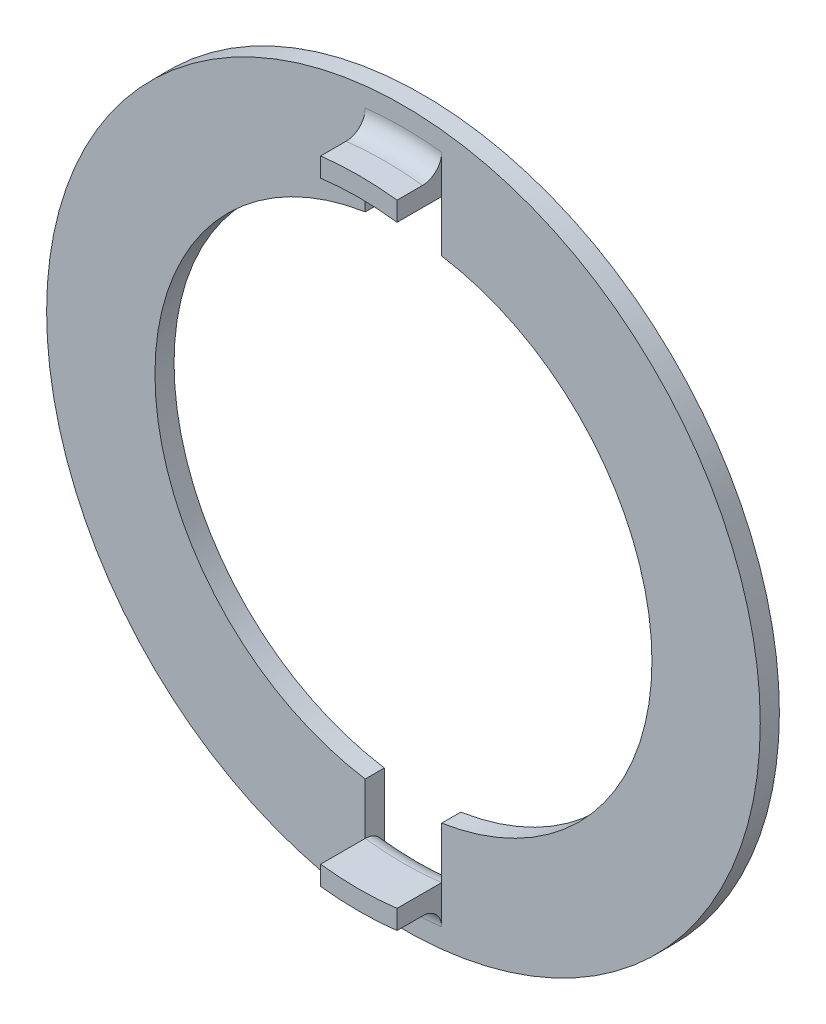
ISO-10303-21;
HEADER;
FILE_DESCRIPTION(('STEP AP214'),'2;1');
FILE_NAME('part.step','',(''),(''),'','','');
FILE_SCHEMA(('AUTOMOTIVE_DESIGN { 1 0 10303 214 1 1 1 1 }'));
ENDSEC;
DATA;
#1=APPLICATION_CONTEXT('core data for automotive mechanical design processes');
#2=APPLICATION_PROTOCOL_DEFINITION('international standard','automotive_design',2000,#1);
#3=PRODUCT_CONTEXT('',#1,'mechanical');
#4=PRODUCT('Part','Part','',(#3));
#5=PRODUCT_RELATED_PRODUCT_CATEGORY('part','',(#4));
#6=PRODUCT_DEFINITION_FORMATION('','',#4);
#7=PRODUCT_DEFINITION_CONTEXT('part definition',#1,'design');
#8=PRODUCT_DEFINITION('design','',#6,#7);
#9=PRODUCT_DEFINITION_SHAPE('','',#8);
#10=(LENGTH_UNIT() NAMED_UNIT(*) SI_UNIT(.MILLI.,.METRE.));
#11=(NAMED_UNIT(*) PLANE_ANGLE_UNIT() SI_UNIT($,.RADIAN.));
#12=(NAMED_UNIT(*) SI_UNIT($,.STERADIAN.) SOLID_ANGLE_UNIT());
#13=UNCERTAINTY_MEASURE_WITH_UNIT(LENGTH_MEASURE(1.E-05),#10,'distance_accuracy_value','');
#14=(GEOMETRIC_REPRESENTATION_CONTEXT(3) GLOBAL_UNCERTAINTY_ASSIGNED_CONTEXT((#13)) GLOBAL_UNIT_ASSIGNED_CONTEXT((#10,
#11,#12)) REPRESENTATION_CONTEXT('',''));
#15=CARTESIAN_POINT('',(0.,0.,0.));
#16=DIRECTION('',(0.,0.,1.));
#17=DIRECTION('',(1.,0.,0.));
#18=AXIS2_PLACEMENT_3D('',#15,#16,#17);
#19=CARTESIAN_POINT('',(0.,0.,1.5));
#20=DIRECTION('',(0.,0.,1.));
#21=DIRECTION('',(1.,0.,0.));
#22=AXIS2_PLACEMENT_3D('',#19,#20,#21);
#23=PLANE('',#22);
#24=CARTESIAN_POINT('',(0.,0.,1.5));
#25=DIRECTION('',(0.,0.,1.));
#26=DIRECTION('',(1.,0.,0.));
#27=AXIS2_PLACEMENT_3D('',#24,#25,#26);
#28=CIRCLE('',#27,28.);
#29=CARTESIAN_POINT('',(28.,0.,1.5));
#30=VERTEX_POINT('',#29);
#31=EDGE_CURVE('E334',#30,#30,#28,.T.);
#32=ORIENTED_EDGE('',*,*,#31,.T.);
#33=EDGE_LOOP('',(#32));
#34=FACE_BOUND('',#33,.T.);
#35=DIRECTION('',(0.,-1.,0.));
#36=VECTOR('',#35,1.);
#37=CARTESIAN_POINT('',(-3.,24.8193472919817,1.5));
#38=LINE('',#37,#36);
#39=CARTESIAN_POINT('',(-3.,26.3296410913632,1.5));
#40=VERTEX_POINT('',#39);
#41=CARTESIAN_POINT('',(-3.,23.3077240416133,1.5));
#42=VERTEX_POINT('',#41);
#43=EDGE_CURVE('E192',#40,#42,#38,.T.);
#44=ORIENTED_EDGE('',*,*,#43,.F.);
#45=CARTESIAN_POINT('',(0.,0.,1.5));
#46=DIRECTION('',(0.,0.,1.));
#47=DIRECTION('',(1.,0.,0.));
#48=AXIS2_PLACEMENT_3D('',#45,#46,#47);
#49=CIRCLE('',#48,26.5);
#50=CARTESIAN_POINT('',(3.,26.3296410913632,1.5));
#51=VERTEX_POINT('',#50);
#52=EDGE_CURVE('E190',#40,#51,#49,.F.);
#53=ORIENTED_EDGE('',*,*,#52,.T.);
#54=DIRECTION('',(0.,1.,0.));
#55=VECTOR('',#54,1.);
#56=CARTESIAN_POINT('',(3.,24.8193472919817,1.5));
#57=LINE('',#56,#55);
#58=CARTESIAN_POINT('',(3.,23.3077240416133,1.5));
#59=VERTEX_POINT('',#58);
#60=EDGE_CURVE('E176',#59,#51,#57,.T.);
#61=ORIENTED_EDGE('',*,*,#60,.F.);
#62=DIRECTION('',(0.,1.,0.));
#63=VECTOR('',#62,1.);
#64=CARTESIAN_POINT('',(3.,23.3077240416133,1.5));
#65=LINE('',#64,#63);
#66=CARTESIAN_POINT('',(3.,19.2678488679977,1.5));
#67=VERTEX_POINT('',#66);
#68=EDGE_CURVE('E188',#67,#59,#65,.T.);
#69=ORIENTED_EDGE('',*,*,#68,.F.);
#70=CARTESIAN_POINT('',(0.,0.,1.5));
#71=DIRECTION('',(0.,0.,1.));
#72=DIRECTION('',(1.,0.,0.));
#73=AXIS2_PLACEMENT_3D('',#70,#71,#72);
#74=CIRCLE('',#73,19.5);
#75=CARTESIAN_POINT('',(3.,-19.2678488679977,1.5));
#76=VERTEX_POINT('',#75);
#77=EDGE_CURVE('E328',#76,#67,#74,.T.);
#78=ORIENTED_EDGE('',*,*,#77,.F.);
#79=DIRECTION('',(0.,1.,0.));
#80=VECTOR('',#79,1.);
#81=CARTESIAN_POINT('',(3.00000000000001,-19.2678488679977,1.5));
#82=LINE('',#81,#80);
#83=CARTESIAN_POINT('',(3.00000000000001,-23.3077240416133,1.5));
#84=VERTEX_POINT('',#83);
#85=EDGE_CURVE('E393',#84,#76,#82,.T.);
#86=ORIENTED_EDGE('',*,*,#85,.F.);
#87=DIRECTION('',(0.,1.,0.));
#88=VECTOR('',#87,1.);
#89=CARTESIAN_POINT('',(3.,-23.3077240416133,1.5));
#90=LINE('',#89,#88);
#91=CARTESIAN_POINT('',(3.,-26.3296410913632,1.5));
#92=VERTEX_POINT('',#91);
#93=EDGE_CURVE('E371',#92,#84,#90,.T.);
#94=ORIENTED_EDGE('',*,*,#93,.F.);
#95=CARTESIAN_POINT('',(0.,0.,1.5));
#96=DIRECTION('',(0.,0.,1.));
#97=DIRECTION('',(1.,0.,0.));
#98=AXIS2_PLACEMENT_3D('',#95,#96,#97);
#99=CIRCLE('',#98,26.5);
#100=CARTESIAN_POINT('',(-3.,-26.3296410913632,1.5));
#101=VERTEX_POINT('',#100);
#102=EDGE_CURVE('E339',#92,#101,#99,.F.);
#103=ORIENTED_EDGE('',*,*,#102,.T.);
#104=DIRECTION('',(0.,-1.,0.));
#105=VECTOR('',#104,1.);
#106=CARTESIAN_POINT('',(-3.,-23.3077240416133,1.5));
#107=LINE('',#106,#105);
#108=CARTESIAN_POINT('',(-2.99999999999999,-23.3077240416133,1.5));
#109=VERTEX_POINT('',#108);
#110=EDGE_CURVE('E181',#109,#101,#107,.T.);
#111=ORIENTED_EDGE('',*,*,#110,.F.);
#112=DIRECTION('',(0.,-1.,0.));
#113=VECTOR('',#112,1.);
#114=CARTESIAN_POINT('',(-2.99999999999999,-19.2678488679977,1.5));
#115=LINE('',#114,#113);
#116=CARTESIAN_POINT('',(-2.99999999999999,-19.2678488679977,1.5));
#117=VERTEX_POINT('',#116);
#118=EDGE_CURVE('E395',#117,#109,#115,.T.);
#119=ORIENTED_EDGE('',*,*,#118,.F.);
#120=CARTESIAN_POINT('',(-3.,19.2678488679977,1.5));
#121=VERTEX_POINT('',#120);
#122=EDGE_CURVE('E323',#121,#117,#74,.T.);
#123=ORIENTED_EDGE('',*,*,#122,.F.);
#124=DIRECTION('',(0.,-1.,0.));
#125=VECTOR('',#124,1.);
#126=CARTESIAN_POINT('',(-3.,23.3077240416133,1.5));
#127=LINE('',#126,#125);
#128=EDGE_CURVE('E203',#42,#121,#127,.T.);
#129=ORIENTED_EDGE('',*,*,#128,.F.);
#130=EDGE_LOOP('',(#44,#53,#61,#69,#78,#86,#94,#103,#111,#119,#123,#129));
#131=FACE_BOUND('',#130,.T.);
#132=ADVANCED_FACE('F37',(#34,#131),#23,.T.);
#133=CARTESIAN_POINT('',(0.,0.,0.));
#134=DIRECTION('',(0.,0.,1.));
#135=DIRECTION('',(1.,0.,0.));
#136=AXIS2_PLACEMENT_3D('',#133,#134,#135);
#137=CYLINDRICAL_SURFACE('',#136,19.5);
#138=ORIENTED_EDGE('',*,*,#122,.T.);
#139=DIRECTION('',(0.,0.,1.));
#140=VECTOR('',#139,1.);
#141=CARTESIAN_POINT('',(-2.99999999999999,-19.2678488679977,0.));
#142=LINE('',#141,#140);
#143=CARTESIAN_POINT('',(-2.99999999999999,-19.2678488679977,0.));
#144=VERTEX_POINT('',#143);
#145=EDGE_CURVE('E204',#144,#117,#142,.T.);
#146=ORIENTED_EDGE('',*,*,#145,.F.);
#147=CARTESIAN_POINT('',(0.,0.,0.));
#148=DIRECTION('',(0.,0.,1.));
#149=DIRECTION('',(1.,0.,0.));
#150=AXIS2_PLACEMENT_3D('',#147,#148,#149);
#151=CIRCLE('',#150,19.5);
#152=CARTESIAN_POINT('',(-3.,19.2678488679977,0.));
#153=VERTEX_POINT('',#152);
#154=EDGE_CURVE('E322',#153,#144,#151,.T.);
#155=ORIENTED_EDGE('',*,*,#154,.F.);
#156=DIRECTION('',(0.,0.,1.));
#157=VECTOR('',#156,1.);
#158=CARTESIAN_POINT('',(-3.,19.2678488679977,0.));
#159=LINE('',#158,#157);
#160=EDGE_CURVE('E410',#153,#121,#159,.T.);
#161=ORIENTED_EDGE('',*,*,#160,.T.);
#162=EDGE_LOOP('',(#138,#146,#155,#161));
#163=FACE_BOUND('',#162,.T.);
#164=ADVANCED_FACE('F298',(#163),#137,.F.);
#165=CARTESIAN_POINT('',(0.,0.,1.5));
#166=DIRECTION('',(0.,0.,-1.));
#167=DIRECTION('',(-1.,0.,0.));
#168=AXIS2_PLACEMENT_3D('',#165,#166,#167);
#169=CYLINDRICAL_SURFACE('',#168,28.);
#170=ORIENTED_EDGE('',*,*,#31,.F.);
#171=EDGE_LOOP('',(#170));
#172=FACE_BOUND('',#171,.T.);
#173=CARTESIAN_POINT('',(0.,0.,0.));
#174=DIRECTION('',(0.,0.,1.));
#175=DIRECTION('',(1.,0.,0.));
#176=AXIS2_PLACEMENT_3D('',#173,#174,#175);
#177=CIRCLE('',#176,28.);
#178=CARTESIAN_POINT('',(28.,0.,0.));
#179=VERTEX_POINT('',#178);
#180=EDGE_CURVE('E326',#179,#179,#177,.T.);
#181=ORIENTED_EDGE('',*,*,#180,.T.);
#182=EDGE_LOOP('',(#181));
#183=FACE_BOUND('',#182,.T.);
#184=ADVANCED_FACE('F39',(#172,#183),#169,.T.);
#185=CARTESIAN_POINT('',(0.,0.,0.));
#186=DIRECTION('',(0.,0.,1.));
#187=DIRECTION('',(1.,0.,0.));
#188=AXIS2_PLACEMENT_3D('',#185,#186,#187);
#189=PLANE('',#188);
#190=CARTESIAN_POINT('',(0.,0.,0.));
#191=DIRECTION('',(0.,0.,1.));
#192=DIRECTION('',(1.,0.,0.));
#193=AXIS2_PLACEMENT_3D('',#190,#191,#192);
#194=CIRCLE('',#193,25.);
#195=CARTESIAN_POINT('',(3.,24.8193472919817,0.));
#196=VERTEX_POINT('',#195);
#197=CARTESIAN_POINT('',(-3.,24.8193472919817,0.));
#198=VERTEX_POINT('',#197);
#199=EDGE_CURVE('E171',#196,#198,#194,.T.);
#200=ORIENTED_EDGE('',*,*,#199,.T.);
#201=DIRECTION('',(0.,-1.,0.));
#202=VECTOR('',#201,1.);
#203=CARTESIAN_POINT('',(-3.,23.3077240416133,0.));
#204=LINE('',#203,#202);
#205=EDGE_CURVE('E407',#198,#153,#204,.T.);
#206=ORIENTED_EDGE('',*,*,#205,.T.);
#207=ORIENTED_EDGE('',*,*,#154,.T.);
#208=DIRECTION('',(0.,-1.,0.));
#209=VECTOR('',#208,1.);
#210=CARTESIAN_POINT('',(-2.99999999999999,-19.2678488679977,0.));
#211=LINE('',#210,#209);
#212=CARTESIAN_POINT('',(-2.99999999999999,-24.8193472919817,0.));
#213=VERTEX_POINT('',#212);
#214=EDGE_CURVE('E400',#144,#213,#211,.T.);
#215=ORIENTED_EDGE('',*,*,#214,.T.);
#216=CARTESIAN_POINT('',(0.,0.,0.));
#217=DIRECTION('',(0.,0.,1.));
#218=DIRECTION('',(1.,0.,0.));
#219=AXIS2_PLACEMENT_3D('',#216,#217,#218);
#220=CIRCLE('',#219,25.);
#221=CARTESIAN_POINT('',(3.00000000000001,-24.8193472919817,0.));
#222=VERTEX_POINT('',#221);
#223=EDGE_CURVE('E343',#213,#222,#220,.T.);
#224=ORIENTED_EDGE('',*,*,#223,.T.);
#225=DIRECTION('',(0.,1.,0.));
#226=VECTOR('',#225,1.);
#227=CARTESIAN_POINT('',(3.00000000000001,-19.2678488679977,0.));
#228=LINE('',#227,#226);
#229=CARTESIAN_POINT('',(3.,-19.2678488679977,0.));
#230=VERTEX_POINT('',#229);
#231=EDGE_CURVE('E398',#222,#230,#228,.T.);
#232=ORIENTED_EDGE('',*,*,#231,.T.);
#233=CARTESIAN_POINT('',(3.,19.2678488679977,0.));
#234=VERTEX_POINT('',#233);
#235=EDGE_CURVE('E319',#230,#234,#151,.T.);
#236=ORIENTED_EDGE('',*,*,#235,.T.);
#237=DIRECTION('',(0.,1.,0.));
#238=VECTOR('',#237,1.);
#239=CARTESIAN_POINT('',(3.,23.3077240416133,0.));
#240=LINE('',#239,#238);
#241=EDGE_CURVE('E405',#234,#196,#240,.T.);
#242=ORIENTED_EDGE('',*,*,#241,.T.);
#243=EDGE_LOOP('',(#200,#206,#207,#215,#224,#232,#236,#242));
#244=FACE_BOUND('',#243,.T.);
#245=ORIENTED_EDGE('',*,*,#180,.F.);
#246=EDGE_LOOP('',(#245));
#247=FACE_BOUND('',#246,.T.);
#248=ADVANCED_FACE('F307',(#244,#247),#189,.F.);
#249=ORIENTED_EDGE('',*,*,#235,.F.);
#250=DIRECTION('',(0.,0.,1.));
#251=VECTOR('',#250,1.);
#252=CARTESIAN_POINT('',(3.,-19.2678488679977,0.));
#253=LINE('',#252,#251);
#254=EDGE_CURVE('E320',#230,#76,#253,.T.);
#255=ORIENTED_EDGE('',*,*,#254,.T.);
#256=ORIENTED_EDGE('',*,*,#77,.T.);
#257=DIRECTION('',(0.,0.,1.));
#258=VECTOR('',#257,1.);
#259=CARTESIAN_POINT('',(3.,19.2678488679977,0.));
#260=LINE('',#259,#258);
#261=EDGE_CURVE('E202',#234,#67,#260,.T.);
#262=ORIENTED_EDGE('',*,*,#261,.F.);
#263=EDGE_LOOP('',(#249,#255,#256,#262));
#264=FACE_BOUND('',#263,.T.);
#265=ADVANCED_FACE('F304',(#264),#137,.F.);
#266=CARTESIAN_POINT('',(-3.,23.3077240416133,0.));
#267=DIRECTION('',(-1.,0.,0.));
#268=DIRECTION('',(0.,-1.,0.));
#269=AXIS2_PLACEMENT_3D('',#266,#267,#268);
#270=PLANE('',#269);
#271=ORIENTED_EDGE('',*,*,#128,.T.);
#272=ORIENTED_EDGE('',*,*,#160,.F.);
#273=ORIENTED_EDGE('',*,*,#205,.F.);
#274=CARTESIAN_POINT('',(-3.,24.8193472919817,0.));
#275=CARTESIAN_POINT('',(-3.,24.7765864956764,4.46070694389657E-07));
#276=CARTESIAN_POINT('',(-3.,24.7338461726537,0.00180326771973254));
#277=CARTESIAN_POINT('',(-3.,24.6486700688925,0.00899574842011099));
#278=CARTESIAN_POINT('',(-3.,24.6062342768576,0.0143852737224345));
#279=CARTESIAN_POINT('',(-3.,24.4798970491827,0.0358863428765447));
#280=CARTESIAN_POINT('',(-3.,24.3968396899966,0.0573305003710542));
#281=CARTESIAN_POINT('',(-3.,24.2355026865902,0.113864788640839));
#282=CARTESIAN_POINT('',(-3.,24.1572256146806,0.148962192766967));
#283=CARTESIAN_POINT('',(-3.,24.0077031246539,0.231833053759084));
#284=CARTESIAN_POINT('',(-3.,23.9364561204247,0.279603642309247));
#285=CARTESIAN_POINT('',(-3.,23.8032556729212,0.386338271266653));
#286=CARTESIAN_POINT('',(-3.,23.7412754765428,0.445268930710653));
#287=CARTESIAN_POINT('',(-3.,23.6281618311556,0.57278183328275));
#288=CARTESIAN_POINT('',(-3.,23.577030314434,0.641365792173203));
#289=CARTESIAN_POINT('',(-3.,23.4874738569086,0.78570580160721));
#290=CARTESIAN_POINT('',(-3.,23.4489624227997,0.861408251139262));
#291=CARTESIAN_POINT('',(-3.,23.3853259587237,1.01821950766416));
#292=CARTESIAN_POINT('',(-3.,23.3601915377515,1.09932447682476));
#293=CARTESIAN_POINT('',(-3.,23.3306873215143,1.23415709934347));
#294=CARTESIAN_POINT('',(-3.,23.322081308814,1.28699530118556));
#295=CARTESIAN_POINT('',(-3.,23.3106007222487,1.39321448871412));
#296=CARTESIAN_POINT('',(-3.,23.3077180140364,1.4465945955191));
#297=CARTESIAN_POINT('',(-3.,23.3077240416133,1.5));
#298=B_SPLINE_CURVE_WITH_KNOTS('',3,(#274,#275,#276,#277,#278,#279,#280,#281,#282,#283,#284,
#285,#286,#287,#288,#289,#290,#291,#292,#293,#294,#295,#296,#297),.UNSPECIFIED.,.F.,.F.,(4,2,2,
2,2,2,2,2,2,2,2,4),(0.,0.128203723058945,0.256402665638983,0.512427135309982,0.768588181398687,
1.02469130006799,1.28004015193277,1.53543444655,1.78903985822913,2.04246699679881,
2.20278418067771,2.36287334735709),.UNSPECIFIED.);
#299=EDGE_CURVE('E208',#198,#42,#298,.T.);
#300=ORIENTED_EDGE('',*,*,#299,.T.);
#301=EDGE_LOOP('',(#271,#272,#273,#300));
#302=FACE_BOUND('',#301,.T.);
#303=ADVANCED_FACE('F311',(#302),#270,.F.);
#304=CARTESIAN_POINT('',(0.,0.,0.));
#305=DIRECTION('',(0.,0.,1.));
#306=DIRECTION('',(1.,0.,0.));
#307=AXIS2_PLACEMENT_3D('',#304,#305,#306);
#308=CYLINDRICAL_SURFACE('',#307,23.5);
#309=DIRECTION('',(0.,0.,-1.));
#310=VECTOR('',#309,1.);
#311=CARTESIAN_POINT('',(-3.,23.3077240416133,5.));
#312=LINE('',#311,#310);
#313=CARTESIAN_POINT('',(-3.,23.3077240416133,5.));
#314=VERTEX_POINT('',#313);
#315=EDGE_CURVE('E165',#314,#42,#312,.T.);
#316=ORIENTED_EDGE('',*,*,#315,.T.);
#317=CARTESIAN_POINT('',(0.,0.,1.5));
#318=DIRECTION('',(0.,0.,1.));
#319=DIRECTION('',(1.,0.,0.));
#320=AXIS2_PLACEMENT_3D('',#317,#318,#319);
#321=CIRCLE('',#320,23.5);
#322=EDGE_CURVE('E159',#42,#59,#321,.F.);
#323=ORIENTED_EDGE('',*,*,#322,.T.);
#324=DIRECTION('',(0.,0.,-1.));
#325=VECTOR('',#324,1.);
#326=CARTESIAN_POINT('',(3.,23.3077240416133,5.));
#327=LINE('',#326,#325);
#328=CARTESIAN_POINT('',(3.,23.3077240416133,5.));
#329=VERTEX_POINT('',#328);
#330=EDGE_CURVE('E163',#329,#59,#327,.T.);
#331=ORIENTED_EDGE('',*,*,#330,.F.);
#332=CARTESIAN_POINT('',(0.,0.,5.));
#333=DIRECTION('',(0.,0.,-1.));
#334=DIRECTION('',(1.,0.,0.));
#335=AXIS2_PLACEMENT_3D('',#332,#333,#334);
#336=CIRCLE('',#335,23.5);
#337=EDGE_CURVE('E428',#314,#329,#336,.T.);
#338=ORIENTED_EDGE('',*,*,#337,.F.);
#339=EDGE_LOOP('',(#316,#323,#331,#338));
#340=FACE_BOUND('',#339,.T.);
#341=ADVANCED_FACE('F161',(#340),#308,.F.);
#342=CARTESIAN_POINT('',(3.,23.3077240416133,0.));
#343=DIRECTION('',(1.,0.,0.));
#344=DIRECTION('',(0.,1.,0.));
#345=AXIS2_PLACEMENT_3D('',#342,#343,#344);
#346=PLANE('',#345);
#347=ORIENTED_EDGE('',*,*,#68,.T.);
#348=CARTESIAN_POINT('',(3.,23.3077240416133,1.5));
#349=CARTESIAN_POINT('',(3.,23.3077241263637,1.45804395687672));
#350=CARTESIAN_POINT('',(3.,23.3095000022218,1.41610810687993));
#351=CARTESIAN_POINT('',(3.,23.316583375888,1.33253852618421));
#352=CARTESIAN_POINT('',(3.,23.3218906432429,1.29090477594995));
#353=CARTESIAN_POINT('',(3.,23.3430532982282,1.16699701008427));
#354=CARTESIAN_POINT('',(3.,23.3641497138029,1.08555624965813));
#355=CARTESIAN_POINT('',(3.,23.4197038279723,0.927379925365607));
#356=CARTESIAN_POINT('',(3.,23.4541668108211,0.850646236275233));
#357=CARTESIAN_POINT('',(3.,23.5354371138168,0.704022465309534));
#358=CARTESIAN_POINT('',(3.,23.582243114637,0.634131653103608));
#359=CARTESIAN_POINT('',(3.,23.6870368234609,0.502884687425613));
#360=CARTESIAN_POINT('',(3.,23.7450655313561,0.441561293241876));
#361=CARTESIAN_POINT('',(3.,23.8705375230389,0.329424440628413));
#362=CARTESIAN_POINT('',(3.,23.9379828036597,0.278613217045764));
#363=CARTESIAN_POINT('',(3.,24.0809208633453,0.188539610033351));
#364=CARTESIAN_POINT('',(3.,24.1564724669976,0.149370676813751));
#365=CARTESIAN_POINT('',(3.,24.3130366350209,0.0841951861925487));
#366=CARTESIAN_POINT('',(3.,24.3940465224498,0.0581822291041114));
#367=CARTESIAN_POINT('',(3.,24.5327962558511,0.0261042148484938));
#368=CARTESIAN_POINT('',(3.,24.5897053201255,0.0163216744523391));
#369=CARTESIAN_POINT('',(3.,24.7041844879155,0.00327005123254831));
#370=CARTESIAN_POINT('',(3.,24.7617535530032,-8.1425717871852E-06));
#371=CARTESIAN_POINT('',(3.,24.8193472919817,0.));
#372=B_SPLINE_CURVE_WITH_KNOTS('',3,(#348,#349,#350,#351,#352,#353,#354,#355,#356,#357,#358,
#359,#360,#361,#362,#363,#364,#365,#366,#367,#368,#369,#370,#371),.UNSPECIFIED.,.F.,.F.,(4,2,2,
2,2,2,2,2,2,2,2,4),(0.,0.125790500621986,0.251572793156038,0.502662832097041,0.753852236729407,
1.00501480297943,1.25711289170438,1.50926452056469,1.76338860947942,2.01738896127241,
2.19027142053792,2.36291154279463),.UNSPECIFIED.);
#373=EDGE_CURVE('E199',#59,#196,#372,.T.);
#374=ORIENTED_EDGE('',*,*,#373,.T.);
#375=ORIENTED_EDGE('',*,*,#241,.F.);
#376=ORIENTED_EDGE('',*,*,#261,.T.);
#377=EDGE_LOOP('',(#347,#374,#375,#376));
#378=FACE_BOUND('',#377,.T.);
#379=ADVANCED_FACE('F197',(#378),#346,.F.);
#380=CARTESIAN_POINT('',(0.,0.,0.));
#381=DIRECTION('',(0.,0.,1.));
#382=DIRECTION('',(1.,0.,0.));
#383=AXIS2_PLACEMENT_3D('',#380,#381,#382);
#384=CYLINDRICAL_SURFACE('',#383,23.5);
#385=DIRECTION('',(0.,0.,-1.));
#386=VECTOR('',#385,1.);
#387=CARTESIAN_POINT('',(3.,-23.3077240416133,5.));
#388=LINE('',#387,#386);
#389=CARTESIAN_POINT('',(3.,-23.3077240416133,5.));
#390=VERTEX_POINT('',#389);
#391=EDGE_CURVE('E383',#390,#84,#388,.T.);
#392=ORIENTED_EDGE('',*,*,#391,.T.);
#393=CARTESIAN_POINT('',(0.,0.,1.5));
#394=DIRECTION('',(0.,0.,1.));
#395=DIRECTION('',(1.,0.,0.));
#396=AXIS2_PLACEMENT_3D('',#393,#394,#395);
#397=CIRCLE('',#396,23.5);
#398=EDGE_CURVE('E347',#84,#109,#397,.F.);
#399=ORIENTED_EDGE('',*,*,#398,.T.);
#400=DIRECTION('',(0.,0.,-1.));
#401=VECTOR('',#400,1.);
#402=CARTESIAN_POINT('',(-3.,-23.3077240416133,5.));
#403=LINE('',#402,#401);
#404=CARTESIAN_POINT('',(-3.,-23.3077240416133,5.));
#405=VERTEX_POINT('',#404);
#406=EDGE_CURVE('E390',#405,#109,#403,.T.);
#407=ORIENTED_EDGE('',*,*,#406,.F.);
#408=CARTESIAN_POINT('',(0.,0.,5.));
#409=DIRECTION('',(0.,0.,-1.));
#410=DIRECTION('',(1.,0.,0.));
#411=AXIS2_PLACEMENT_3D('',#408,#409,#410);
#412=CIRCLE('',#411,23.5);
#413=EDGE_CURVE('E374',#390,#405,#412,.T.);
#414=ORIENTED_EDGE('',*,*,#413,.F.);
#415=EDGE_LOOP('',(#392,#399,#407,#414));
#416=FACE_BOUND('',#415,.T.);
#417=ADVANCED_FACE('F419',(#416),#384,.F.);
#418=CARTESIAN_POINT('',(-2.99999999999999,-19.2678488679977,0.));
#419=DIRECTION('',(-1.,0.,0.));
#420=DIRECTION('',(0.,-1.,0.));
#421=AXIS2_PLACEMENT_3D('',#418,#419,#420);
#422=PLANE('',#421);
#423=ORIENTED_EDGE('',*,*,#118,.T.);
#424=CARTESIAN_POINT('',(-2.99999999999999,-23.3077240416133,1.5));
#425=CARTESIAN_POINT('',(-2.99999999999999,-23.3077241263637,1.45804395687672));
#426=CARTESIAN_POINT('',(-2.99999999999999,-23.3095000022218,1.41610810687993));
#427=CARTESIAN_POINT('',(-2.99999999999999,-23.316583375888,1.33253852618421));
#428=CARTESIAN_POINT('',(-2.99999999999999,-23.3218906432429,1.29090477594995));
#429=CARTESIAN_POINT('',(-2.99999999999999,-23.3430532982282,1.16699701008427));
#430=CARTESIAN_POINT('',(-2.99999999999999,-23.3641497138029,1.08555624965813));
#431=CARTESIAN_POINT('',(-2.99999999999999,-23.4197038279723,0.927379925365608));
#432=CARTESIAN_POINT('',(-2.99999999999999,-23.4541668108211,0.850646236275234));
#433=CARTESIAN_POINT('',(-2.99999999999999,-23.5354371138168,0.704022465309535));
#434=CARTESIAN_POINT('',(-2.99999999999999,-23.582243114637,0.634131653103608));
#435=CARTESIAN_POINT('',(-2.99999999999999,-23.6870368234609,0.502884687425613));
#436=CARTESIAN_POINT('',(-2.99999999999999,-23.7450655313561,0.441561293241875));
#437=CARTESIAN_POINT('',(-2.99999999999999,-23.8705375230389,0.329424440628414));
#438=CARTESIAN_POINT('',(-2.99999999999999,-23.9379828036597,0.278613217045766));
#439=CARTESIAN_POINT('',(-2.99999999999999,-24.0809208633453,0.188539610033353));
#440=CARTESIAN_POINT('',(-2.99999999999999,-24.1564724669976,0.149370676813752));
#441=CARTESIAN_POINT('',(-2.99999999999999,-24.3130366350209,0.0841951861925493));
#442=CARTESIAN_POINT('',(-2.99999999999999,-24.3940465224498,0.0581822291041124));
#443=CARTESIAN_POINT('',(-2.99999999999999,-24.5327962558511,0.0261042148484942));
#444=CARTESIAN_POINT('',(-2.99999999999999,-24.5897053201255,0.0163216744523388));
#445=CARTESIAN_POINT('',(-2.99999999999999,-24.7041844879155,0.00327005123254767));
#446=CARTESIAN_POINT('',(-2.99999999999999,-24.7617535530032,-8.14257178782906E-06));
#447=CARTESIAN_POINT('',(-2.99999999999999,-24.8193472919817,0.));
#448=B_SPLINE_CURVE_WITH_KNOTS('',3,(#424,#425,#426,#427,#428,#429,#430,#431,#432,#433,#434,
#435,#436,#437,#438,#439,#440,#441,#442,#443,#444,#445,#446,#447),.UNSPECIFIED.,.F.,.F.,(4,2,2,
2,2,2,2,2,2,2,2,4),(0.,0.125790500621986,0.251572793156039,0.502662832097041,0.753852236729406,
1.00501480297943,1.25711289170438,1.50926452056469,1.76338860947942,2.01738896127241,
2.19027142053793,2.36291154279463),.UNSPECIFIED.);
#449=EDGE_CURVE('E11',#109,#213,#448,.T.);
#450=ORIENTED_EDGE('',*,*,#449,.T.);
#451=ORIENTED_EDGE('',*,*,#214,.F.);
#452=ORIENTED_EDGE('',*,*,#145,.T.);
#453=EDGE_LOOP('',(#423,#450,#451,#452));
#454=FACE_BOUND('',#453,.T.);
#455=ADVANCED_FACE('F277',(#454),#422,.F.);
#456=CARTESIAN_POINT('',(3.00000000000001,-19.2678488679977,0.));
#457=DIRECTION('',(1.,0.,0.));
#458=DIRECTION('',(0.,1.,0.));
#459=AXIS2_PLACEMENT_3D('',#456,#457,#458);
#460=PLANE('',#459);
#461=ORIENTED_EDGE('',*,*,#85,.T.);
#462=ORIENTED_EDGE('',*,*,#254,.F.);
#463=ORIENTED_EDGE('',*,*,#231,.F.);
#464=CARTESIAN_POINT('',(3.00000000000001,-24.8193472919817,0.));
#465=CARTESIAN_POINT('',(3.00000000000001,-24.7765864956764,4.46070694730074E-07));
#466=CARTESIAN_POINT('',(3.00000000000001,-24.7338461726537,0.00180326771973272));
#467=CARTESIAN_POINT('',(3.00000000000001,-24.6486700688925,0.00899574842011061));
#468=CARTESIAN_POINT('',(3.00000000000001,-24.6062342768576,0.0143852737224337));
#469=CARTESIAN_POINT('',(3.00000000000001,-24.4798970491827,0.0358863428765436));
#470=CARTESIAN_POINT('',(3.00000000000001,-24.3968396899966,0.057330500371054));
#471=CARTESIAN_POINT('',(3.00000000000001,-24.2355026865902,0.11386478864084));
#472=CARTESIAN_POINT('',(3.00000000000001,-24.1572256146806,0.148962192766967));
#473=CARTESIAN_POINT('',(3.00000000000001,-24.0077031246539,0.231833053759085));
#474=CARTESIAN_POINT('',(3.00000000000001,-23.9364561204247,0.279603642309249));
#475=CARTESIAN_POINT('',(3.00000000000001,-23.8032556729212,0.386338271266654));
#476=CARTESIAN_POINT('',(3.00000000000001,-23.7412754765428,0.445268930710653));
#477=CARTESIAN_POINT('',(3.00000000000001,-23.6281618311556,0.572781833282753));
#478=CARTESIAN_POINT('',(3.00000000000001,-23.577030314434,0.641365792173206));
#479=CARTESIAN_POINT('',(3.00000000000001,-23.4874738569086,0.785705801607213));
#480=CARTESIAN_POINT('',(3.00000000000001,-23.4489624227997,0.861408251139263));
#481=CARTESIAN_POINT('',(3.00000000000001,-23.3853259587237,1.01821950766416));
#482=CARTESIAN_POINT('',(3.00000000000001,-23.3601915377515,1.09932447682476));
#483=CARTESIAN_POINT('',(3.00000000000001,-23.3306873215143,1.23415709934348));
#484=CARTESIAN_POINT('',(3.00000000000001,-23.322081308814,1.28699530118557));
#485=CARTESIAN_POINT('',(3.00000000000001,-23.3106007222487,1.39321448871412));
#486=CARTESIAN_POINT('',(3.00000000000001,-23.3077180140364,1.4465945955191));
#487=CARTESIAN_POINT('',(3.00000000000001,-23.3077240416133,1.5));
#488=B_SPLINE_CURVE_WITH_KNOTS('',3,(#464,#465,#466,#467,#468,#469,#470,#471,#472,#473,#474,
#475,#476,#477,#478,#479,#480,#481,#482,#483,#484,#485,#486,#487),.UNSPECIFIED.,.F.,.F.,(4,2,2,
2,2,2,2,2,2,2,2,4),(0.,0.128203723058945,0.256402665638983,0.512427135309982,0.768588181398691,
1.02469130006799,1.28004015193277,1.53543444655,1.78903985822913,2.04246699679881,
2.20278418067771,2.36287334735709),.UNSPECIFIED.);
#489=EDGE_CURVE('E50',#222,#84,#488,.T.);
#490=ORIENTED_EDGE('',*,*,#489,.T.);
#491=EDGE_LOOP('',(#461,#462,#463,#490));
#492=FACE_BOUND('',#491,.T.);
#493=ADVANCED_FACE('F276',(#492),#460,.F.);
#494=CARTESIAN_POINT('',(-3.,-23.3077240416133,5.));
#495=DIRECTION('',(1.,0.,0.));
#496=DIRECTION('',(0.,0.,-1.));
#497=AXIS2_PLACEMENT_3D('',#494,#495,#496);
#498=PLANE('',#497);
#499=ORIENTED_EDGE('',*,*,#110,.T.);
#500=CARTESIAN_POINT('',(-3.,-26.3296410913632,1.5));
#501=CARTESIAN_POINT('',(-3.,-26.2869439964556,1.50000042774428));
#502=CARTESIAN_POINT('',(-3.,-26.2442673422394,1.50180079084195));
#503=CARTESIAN_POINT('',(-3.,-26.1592182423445,1.50898347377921));
#504=CARTESIAN_POINT('',(-3.,-26.1168457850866,1.51436565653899));
#505=CARTESIAN_POINT('',(-3.,-25.9906991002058,1.53583710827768));
#506=CARTESIAN_POINT('',(-3.,-25.9077678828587,1.55725140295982));
#507=CARTESIAN_POINT('',(-3.,-25.7466767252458,1.61370456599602));
#508=CARTESIAN_POINT('',(-3.,-25.6685193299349,1.64875062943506));
#509=CARTESIAN_POINT('',(-3.,-25.5192231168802,1.7314955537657));
#510=CARTESIAN_POINT('',(-3.,-25.448082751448,1.77919161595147));
#511=CARTESIAN_POINT('',(-3.,-25.3150534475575,1.88576950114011));
#512=CARTESIAN_POINT('',(-3.,-25.2531406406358,1.94462153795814));
#513=CARTESIAN_POINT('',(-3.,-25.1401376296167,2.07195911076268));
#514=CARTESIAN_POINT('',(-3.,-25.0890493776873,2.14044638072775));
#515=CARTESIAN_POINT('',(-3.,-24.9995082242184,2.28463813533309));
#516=CARTESIAN_POINT('',(-3.,-24.9609791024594,2.36029534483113));
#517=CARTESIAN_POINT('',(-3.,-24.8972868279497,2.51701620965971));
#518=CARTESIAN_POINT('',(-3.,-24.8721144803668,2.59807610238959));
#519=CARTESIAN_POINT('',(-3.,-24.8424773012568,2.73307320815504));
#520=CARTESIAN_POINT('',(-3.,-24.8338088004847,2.78612450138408));
#521=CARTESIAN_POINT('',(-3.,-24.8222448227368,2.89277603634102));
#522=CARTESIAN_POINT('',(-3.,-24.8193411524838,2.94637538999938));
#523=CARTESIAN_POINT('',(-3.,-24.8193472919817,3.));
#524=B_SPLINE_CURVE_WITH_KNOTS('',3,(#500,#501,#502,#503,#504,#505,#506,#507,#508,#509,#510,
#511,#512,#513,#514,#515,#516,#517,#518,#519,#520,#521,#522,#523),.UNSPECIFIED.,.F.,.F.,(4,2,2,
2,2,2,2,2,2,2,2,4),(0.,0.128012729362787,0.256020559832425,0.511658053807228,0.767430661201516,
1.02314672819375,1.27818941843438,1.53327806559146,1.78678845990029,2.04012410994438,
2.20109911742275,2.36184517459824),.UNSPECIFIED.);
#525=CARTESIAN_POINT('',(-3.,-24.8193472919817,3.));
#526=VERTEX_POINT('',#525);
#527=EDGE_CURVE('E57',#101,#526,#524,.T.);
#528=ORIENTED_EDGE('',*,*,#527,.T.);
#529=DIRECTION('',(0.,0.,-1.));
#530=VECTOR('',#529,1.);
#531=CARTESIAN_POINT('',(-3.,-24.8193472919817,5.));
#532=LINE('',#531,#530);
#533=CARTESIAN_POINT('',(-3.,-24.8193472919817,5.));
#534=VERTEX_POINT('',#533);
#535=EDGE_CURVE('E388',#534,#526,#532,.T.);
#536=ORIENTED_EDGE('',*,*,#535,.F.);
#537=DIRECTION('',(0.,-1.,0.));
#538=VECTOR('',#537,1.);
#539=CARTESIAN_POINT('',(-3.,-23.3077240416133,5.));
#540=LINE('',#539,#538);
#541=EDGE_CURVE('E377',#405,#534,#540,.T.);
#542=ORIENTED_EDGE('',*,*,#541,.F.);
#543=ORIENTED_EDGE('',*,*,#406,.T.);
#544=EDGE_LOOP('',(#499,#528,#536,#542,#543));
#545=FACE_BOUND('',#544,.T.);
#546=ADVANCED_FACE('F272',(#545),#498,.F.);
#547=CARTESIAN_POINT('',(0.,0.,5.));
#548=DIRECTION('',(0.,0.,-1.));
#549=DIRECTION('',(-1.,0.,0.));
#550=AXIS2_PLACEMENT_3D('',#547,#548,#549);
#551=CYLINDRICAL_SURFACE('',#550,25.);
#552=ORIENTED_EDGE('',*,*,#535,.T.);
#553=CARTESIAN_POINT('',(0.,0.,3.));
#554=DIRECTION('',(0.,0.,1.));
#555=DIRECTION('',(1.,0.,0.));
#556=AXIS2_PLACEMENT_3D('',#553,#554,#555);
#557=CIRCLE('',#556,25.);
#558=CARTESIAN_POINT('',(3.,-24.8193472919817,3.));
#559=VERTEX_POINT('',#558);
#560=EDGE_CURVE('E170',#526,#559,#557,.T.);
#561=ORIENTED_EDGE('',*,*,#560,.T.);
#562=DIRECTION('',(0.,0.,-1.));
#563=VECTOR('',#562,1.);
#564=CARTESIAN_POINT('',(3.,-24.8193472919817,5.));
#565=LINE('',#564,#563);
#566=CARTESIAN_POINT('',(3.,-24.8193472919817,5.));
#567=VERTEX_POINT('',#566);
#568=EDGE_CURVE('E385',#567,#559,#565,.T.);
#569=ORIENTED_EDGE('',*,*,#568,.F.);
#570=CARTESIAN_POINT('',(0.,0.,5.));
#571=DIRECTION('',(0.,0.,1.));
#572=DIRECTION('',(1.,0.,0.));
#573=AXIS2_PLACEMENT_3D('',#570,#571,#572);
#574=CIRCLE('',#573,25.);
#575=EDGE_CURVE('E379',#534,#567,#574,.T.);
#576=ORIENTED_EDGE('',*,*,#575,.F.);
#577=EDGE_LOOP('',(#552,#561,#569,#576));
#578=FACE_BOUND('',#577,.T.);
#579=ADVANCED_FACE('F268',(#578),#551,.T.);
#580=CARTESIAN_POINT('',(3.,-23.3077240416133,5.));
#581=DIRECTION('',(-1.,0.,0.));
#582=DIRECTION('',(0.,0.,1.));
#583=AXIS2_PLACEMENT_3D('',#580,#581,#582);
#584=PLANE('',#583);
#585=ORIENTED_EDGE('',*,*,#93,.T.);
#586=ORIENTED_EDGE('',*,*,#391,.F.);
#587=DIRECTION('',(0.,1.,0.));
#588=VECTOR('',#587,1.);
#589=CARTESIAN_POINT('',(3.,-23.3077240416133,5.));
#590=LINE('',#589,#588);
#591=EDGE_CURVE('E381',#567,#390,#590,.T.);
#592=ORIENTED_EDGE('',*,*,#591,.F.);
#593=ORIENTED_EDGE('',*,*,#568,.T.);
#594=CARTESIAN_POINT('',(3.,-24.8193472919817,3.));
#595=CARTESIAN_POINT('',(3.,-24.8193474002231,2.95801547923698));
#596=CARTESIAN_POINT('',(3.,-24.8211239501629,2.91605115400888));
#597=CARTESIAN_POINT('',(3.,-24.8282101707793,2.83242458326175));
#598=CARTESIAN_POINT('',(3.,-24.8335196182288,2.79076231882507));
#599=CARTESIAN_POINT('',(3.,-24.8546917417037,2.66676693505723));
#600=CARTESIAN_POINT('',(3.,-24.8757983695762,2.58526726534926));
#601=CARTESIAN_POINT('',(3.,-24.9313839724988,2.42697505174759));
#602=CARTESIAN_POINT('',(3.,-24.9658683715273,2.35018443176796));
#603=CARTESIAN_POINT('',(3.,-25.0471960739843,2.20345514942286));
#604=CARTESIAN_POINT('',(3.,-25.0940379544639,2.13351569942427));
#605=CARTESIAN_POINT('',(3.,-25.1988975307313,2.00221545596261));
#606=CARTESIAN_POINT('',(3.,-25.2569514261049,1.94088359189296));
#607=CARTESIAN_POINT('',(3.,-25.3824830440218,1.8287444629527));
#608=CARTESIAN_POINT('',(3.,-25.4499627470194,1.77793941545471));
#609=CARTESIAN_POINT('',(3.,-25.592913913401,1.68794043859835));
#610=CARTESIAN_POINT('',(3.,-25.668437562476,1.64882949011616));
#611=CARTESIAN_POINT('',(3.,-25.8249396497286,1.58377534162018));
#612=CARTESIAN_POINT('',(3.,-25.9059153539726,1.55782559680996));
#613=CARTESIAN_POINT('',(3.,-26.0443804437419,1.52591029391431));
#614=CARTESIAN_POINT('',(3.,-26.1010358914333,1.51620032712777));
#615=CARTESIAN_POINT('',(3.,-26.2150003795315,1.5032457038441));
#616=CARTESIAN_POINT('',(3.,-26.2723083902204,1.49999198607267));
#617=CARTESIAN_POINT('',(3.,-26.3296410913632,1.5));
#618=B_SPLINE_CURVE_WITH_KNOTS('',3,(#594,#595,#596,#597,#598,#599,#600,#601,#602,#603,#604,
#605,#606,#607,#608,#609,#610,#611,#612,#613,#614,#615,#616,#617),.UNSPECIFIED.,.F.,.F.,(4,2,2,
2,2,2,2,2,2,2,2,4),(0.,0.125875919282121,0.251743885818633,0.503011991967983,0.754382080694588,
1.00572323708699,1.25788987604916,1.5101095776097,1.76407871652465,2.01792143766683,
2.19002106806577,2.36187898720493),.UNSPECIFIED.);
#619=EDGE_CURVE('E65',#559,#92,#618,.T.);
#620=ORIENTED_EDGE('',*,*,#619,.T.);
#621=EDGE_LOOP('',(#585,#586,#592,#593,#620));
#622=FACE_BOUND('',#621,.T.);
#623=ADVANCED_FACE('F263',(#622),#584,.F.);
#624=CARTESIAN_POINT('',(0.,0.,5.));
#625=DIRECTION('',(0.,0.,1.));
#626=DIRECTION('',(1.,0.,0.));
#627=AXIS2_PLACEMENT_3D('',#624,#625,#626);
#628=PLANE('',#627);
#629=ORIENTED_EDGE('',*,*,#413,.T.);
#630=ORIENTED_EDGE('',*,*,#541,.T.);
#631=ORIENTED_EDGE('',*,*,#575,.T.);
#632=ORIENTED_EDGE('',*,*,#591,.T.);
#633=EDGE_LOOP('',(#629,#630,#631,#632));
#634=FACE_BOUND('',#633,.T.);
#635=ADVANCED_FACE('F261',(#634),#628,.T.);
#636=CARTESIAN_POINT('',(3.,24.8193472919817,5.));
#637=DIRECTION('',(-1.,0.,0.));
#638=DIRECTION('',(0.,0.,1.));
#639=AXIS2_PLACEMENT_3D('',#636,#637,#638);
#640=PLANE('',#639);
#641=ORIENTED_EDGE('',*,*,#60,.T.);
#642=CARTESIAN_POINT('',(3.,26.3296410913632,1.5));
#643=CARTESIAN_POINT('',(3.,26.2869439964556,1.50000042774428));
#644=CARTESIAN_POINT('',(3.,26.2442673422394,1.50180079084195));
#645=CARTESIAN_POINT('',(3.,26.1592182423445,1.50898347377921));
#646=CARTESIAN_POINT('',(3.,26.1168457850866,1.51436565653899));
#647=CARTESIAN_POINT('',(3.,25.9906991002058,1.53583710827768));
#648=CARTESIAN_POINT('',(3.,25.9077678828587,1.55725140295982));
#649=CARTESIAN_POINT('',(3.,25.7466767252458,1.61370456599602));
#650=CARTESIAN_POINT('',(3.,25.6685193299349,1.64875062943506));
#651=CARTESIAN_POINT('',(3.,25.5192231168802,1.7314955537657));
#652=CARTESIAN_POINT('',(3.,25.448082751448,1.77919161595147));
#653=CARTESIAN_POINT('',(3.,25.3150534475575,1.88576950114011));
#654=CARTESIAN_POINT('',(3.,25.2531406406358,1.94462153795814));
#655=CARTESIAN_POINT('',(3.,25.1401376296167,2.07195911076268));
#656=CARTESIAN_POINT('',(3.,25.0890493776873,2.14044638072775));
#657=CARTESIAN_POINT('',(3.,24.9995082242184,2.28463813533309));
#658=CARTESIAN_POINT('',(3.,24.9609791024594,2.36029534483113));
#659=CARTESIAN_POINT('',(3.,24.8972868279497,2.51701620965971));
#660=CARTESIAN_POINT('',(3.,24.8721144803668,2.59807610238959));
#661=CARTESIAN_POINT('',(3.,24.8424773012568,2.73307320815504));
#662=CARTESIAN_POINT('',(3.,24.8338088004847,2.78612450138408));
#663=CARTESIAN_POINT('',(3.,24.8222448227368,2.89277603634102));
#664=CARTESIAN_POINT('',(3.,24.8193411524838,2.94637538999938));
#665=CARTESIAN_POINT('',(3.,24.8193472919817,3.));
#666=B_SPLINE_CURVE_WITH_KNOTS('',3,(#642,#643,#644,#645,#646,#647,#648,#649,#650,#651,#652,
#653,#654,#655,#656,#657,#658,#659,#660,#661,#662,#663,#664,#665),.UNSPECIFIED.,.F.,.F.,(4,2,2,
2,2,2,2,2,2,2,2,4),(0.,0.128012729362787,0.256020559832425,0.511658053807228,0.767430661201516,
1.02314672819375,1.27818941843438,1.53327806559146,1.78678845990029,2.04012410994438,
2.20109911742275,2.36184517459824),.UNSPECIFIED.);
#667=CARTESIAN_POINT('',(3.,24.8193472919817,3.));
#668=VERTEX_POINT('',#667);
#669=EDGE_CURVE('E211',#51,#668,#666,.T.);
#670=ORIENTED_EDGE('',*,*,#669,.T.);
#671=DIRECTION('',(0.,0.,-1.));
#672=VECTOR('',#671,1.);
#673=CARTESIAN_POINT('',(3.,24.8193472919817,5.));
#674=LINE('',#673,#672);
#675=CARTESIAN_POINT('',(3.,24.8193472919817,5.));
#676=VERTEX_POINT('',#675);
#677=EDGE_CURVE('E182',#676,#668,#674,.T.);
#678=ORIENTED_EDGE('',*,*,#677,.F.);
#679=DIRECTION('',(0.,1.,0.));
#680=VECTOR('',#679,1.);
#681=CARTESIAN_POINT('',(3.,24.8193472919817,5.));
#682=LINE('',#681,#680);
#683=EDGE_CURVE('E179',#329,#676,#682,.T.);
#684=ORIENTED_EDGE('',*,*,#683,.F.);
#685=ORIENTED_EDGE('',*,*,#330,.T.);
#686=EDGE_LOOP('',(#641,#670,#678,#684,#685));
#687=FACE_BOUND('',#686,.T.);
#688=ADVANCED_FACE('F175',(#687),#640,.F.);
#689=CARTESIAN_POINT('',(0.,0.,5.));
#690=DIRECTION('',(0.,0.,-1.));
#691=DIRECTION('',(-1.,0.,0.));
#692=AXIS2_PLACEMENT_3D('',#689,#690,#691);
#693=CYLINDRICAL_SURFACE('',#692,25.);
#694=ORIENTED_EDGE('',*,*,#677,.T.);
#695=CARTESIAN_POINT('',(0.,0.,3.));
#696=DIRECTION('',(0.,0.,1.));
#697=DIRECTION('',(1.,0.,0.));
#698=AXIS2_PLACEMENT_3D('',#695,#696,#697);
#699=CIRCLE('',#698,25.);
#700=CARTESIAN_POINT('',(-3.,24.8193472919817,3.));
#701=VERTEX_POINT('',#700);
#702=EDGE_CURVE('E336',#668,#701,#699,.T.);
#703=ORIENTED_EDGE('',*,*,#702,.T.);
#704=DIRECTION('',(0.,0.,-1.));
#705=VECTOR('',#704,1.);
#706=CARTESIAN_POINT('',(-3.,24.8193472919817,5.));
#707=LINE('',#706,#705);
#708=CARTESIAN_POINT('',(-3.,24.8193472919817,5.));
#709=VERTEX_POINT('',#708);
#710=EDGE_CURVE('E360',#709,#701,#707,.T.);
#711=ORIENTED_EDGE('',*,*,#710,.F.);
#712=CARTESIAN_POINT('',(0.,0.,5.));
#713=DIRECTION('',(0.,0.,1.));
#714=DIRECTION('',(1.,0.,0.));
#715=AXIS2_PLACEMENT_3D('',#712,#713,#714);
#716=CIRCLE('',#715,25.);
#717=EDGE_CURVE('E365',#676,#709,#716,.T.);
#718=ORIENTED_EDGE('',*,*,#717,.F.);
#719=EDGE_LOOP('',(#694,#703,#711,#718));
#720=FACE_BOUND('',#719,.T.);
#721=ADVANCED_FACE('F260',(#720),#693,.T.);
#722=CARTESIAN_POINT('',(-3.,24.8193472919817,5.));
#723=DIRECTION('',(1.,0.,0.));
#724=DIRECTION('',(0.,0.,-1.));
#725=AXIS2_PLACEMENT_3D('',#722,#723,#724);
#726=PLANE('',#725);
#727=ORIENTED_EDGE('',*,*,#43,.T.);
#728=ORIENTED_EDGE('',*,*,#315,.F.);
#729=DIRECTION('',(0.,-1.,0.));
#730=VECTOR('',#729,1.);
#731=CARTESIAN_POINT('',(-3.,24.8193472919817,5.));
#732=LINE('',#731,#730);
#733=EDGE_CURVE('E434',#709,#314,#732,.T.);
#734=ORIENTED_EDGE('',*,*,#733,.F.);
#735=ORIENTED_EDGE('',*,*,#710,.T.);
#736=CARTESIAN_POINT('',(-3.,24.8193472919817,3.));
#737=CARTESIAN_POINT('',(-3.,24.8193474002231,2.95801547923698));
#738=CARTESIAN_POINT('',(-3.,24.8211239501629,2.91605115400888));
#739=CARTESIAN_POINT('',(-3.,24.8282101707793,2.83242458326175));
#740=CARTESIAN_POINT('',(-3.,24.8335196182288,2.79076231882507));
#741=CARTESIAN_POINT('',(-3.,24.8546917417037,2.66676693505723));
#742=CARTESIAN_POINT('',(-3.,24.8757983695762,2.58526726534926));
#743=CARTESIAN_POINT('',(-3.,24.9313839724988,2.42697505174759));
#744=CARTESIAN_POINT('',(-3.,24.9658683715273,2.35018443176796));
#745=CARTESIAN_POINT('',(-3.,25.0471960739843,2.20345514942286));
#746=CARTESIAN_POINT('',(-3.,25.0940379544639,2.13351569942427));
#747=CARTESIAN_POINT('',(-3.,25.1988975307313,2.00221545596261));
#748=CARTESIAN_POINT('',(-3.,25.2569514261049,1.94088359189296));
#749=CARTESIAN_POINT('',(-3.,25.3824830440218,1.8287444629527));
#750=CARTESIAN_POINT('',(-3.,25.4499627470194,1.77793941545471));
#751=CARTESIAN_POINT('',(-3.,25.592913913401,1.68794043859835));
#752=CARTESIAN_POINT('',(-3.,25.668437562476,1.64882949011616));
#753=CARTESIAN_POINT('',(-3.,25.8249396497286,1.58377534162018));
#754=CARTESIAN_POINT('',(-3.,25.9059153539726,1.55782559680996));
#755=CARTESIAN_POINT('',(-3.,26.0443804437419,1.52591029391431));
#756=CARTESIAN_POINT('',(-3.,26.1010358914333,1.51620032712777));
#757=CARTESIAN_POINT('',(-3.,26.2150003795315,1.5032457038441));
#758=CARTESIAN_POINT('',(-3.,26.2723083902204,1.49999198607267));
#759=CARTESIAN_POINT('',(-3.,26.3296410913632,1.5));
#760=B_SPLINE_CURVE_WITH_KNOTS('',3,(#736,#737,#738,#739,#740,#741,#742,#743,#744,#745,#746,
#747,#748,#749,#750,#751,#752,#753,#754,#755,#756,#757,#758,#759),.UNSPECIFIED.,.F.,.F.,(4,2,2,
2,2,2,2,2,2,2,2,4),(0.,0.125875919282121,0.251743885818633,0.503011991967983,0.754382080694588,
1.00572323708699,1.25788987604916,1.5101095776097,1.76407871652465,2.01792143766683,
2.19002106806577,2.36187898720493),.UNSPECIFIED.);
#761=EDGE_CURVE('E247',#701,#40,#760,.T.);
#762=ORIENTED_EDGE('',*,*,#761,.T.);
#763=EDGE_LOOP('',(#727,#728,#734,#735,#762));
#764=FACE_BOUND('',#763,.T.);
#765=ADVANCED_FACE('F356',(#764),#726,.F.);
#766=CARTESIAN_POINT('',(0.,0.,5.));
#767=DIRECTION('',(0.,0.,1.));
#768=DIRECTION('',(1.,0.,0.));
#769=AXIS2_PLACEMENT_3D('',#766,#767,#768);
#770=PLANE('',#769);
#771=ORIENTED_EDGE('',*,*,#337,.T.);
#772=ORIENTED_EDGE('',*,*,#683,.T.);
#773=ORIENTED_EDGE('',*,*,#717,.T.);
#774=ORIENTED_EDGE('',*,*,#733,.T.);
#775=EDGE_LOOP('',(#771,#772,#773,#774));
#776=FACE_BOUND('',#775,.T.);
#777=ADVANCED_FACE('F242',(#776),#770,.T.);
#778=CARTESIAN_POINT('',(0.,0.,3.));
#779=DIRECTION('',(0.,0.,1.));
#780=DIRECTION('',(1.,0.,0.));
#781=AXIS2_PLACEMENT_3D('',#778,#779,#780);
#782=TOROIDAL_SURFACE('',#781,26.5,1.5);
#783=ORIENTED_EDGE('',*,*,#669,.F.);
#784=ORIENTED_EDGE('',*,*,#52,.F.);
#785=ORIENTED_EDGE('',*,*,#761,.F.);
#786=ORIENTED_EDGE('',*,*,#702,.F.);
#787=EDGE_LOOP('',(#783,#784,#785,#786));
#788=FACE_BOUND('',#787,.T.);
#789=ADVANCED_FACE('F236',(#788),#782,.F.);
#790=CARTESIAN_POINT('',(0.,0.,1.5));
#791=DIRECTION('',(0.,0.,1.));
#792=DIRECTION('',(1.,0.,0.));
#793=AXIS2_PLACEMENT_3D('',#790,#791,#792);
#794=TOROIDAL_SURFACE('',#793,25.,1.5);
#795=ORIENTED_EDGE('',*,*,#373,.F.);
#796=ORIENTED_EDGE('',*,*,#322,.F.);
#797=ORIENTED_EDGE('',*,*,#299,.F.);
#798=ORIENTED_EDGE('',*,*,#199,.F.);
#799=EDGE_LOOP('',(#795,#796,#797,#798));
#800=FACE_BOUND('',#799,.T.);
#801=ADVANCED_FACE('F206',(#800),#794,.T.);
#802=CARTESIAN_POINT('',(0.,0.,3.));
#803=DIRECTION('',(0.,0.,1.));
#804=DIRECTION('',(1.,0.,0.));
#805=AXIS2_PLACEMENT_3D('',#802,#803,#804);
#806=TOROIDAL_SURFACE('',#805,26.5,1.5);
#807=ORIENTED_EDGE('',*,*,#527,.F.);
#808=ORIENTED_EDGE('',*,*,#102,.F.);
#809=ORIENTED_EDGE('',*,*,#619,.F.);
#810=ORIENTED_EDGE('',*,*,#560,.F.);
#811=EDGE_LOOP('',(#807,#808,#809,#810));
#812=FACE_BOUND('',#811,.T.);
#813=ADVANCED_FACE('F235',(#812),#806,.F.);
#814=CARTESIAN_POINT('',(0.,0.,1.5));
#815=DIRECTION('',(0.,0.,1.));
#816=DIRECTION('',(1.,0.,0.));
#817=AXIS2_PLACEMENT_3D('',#814,#815,#816);
#818=TOROIDAL_SURFACE('',#817,25.,1.5);
#819=ORIENTED_EDGE('',*,*,#449,.F.);
#820=ORIENTED_EDGE('',*,*,#398,.F.);
#821=ORIENTED_EDGE('',*,*,#489,.F.);
#822=ORIENTED_EDGE('',*,*,#223,.F.);
#823=EDGE_LOOP('',(#819,#820,#821,#822));
#824=FACE_BOUND('',#823,.T.);
#825=ADVANCED_FACE('F288',(#824),#818,.T.);
#826=CLOSED_SHELL('',(#132,#164,#184,#248,#265,#303,#341,#379,#417,#455,#493,#546,#579,#623,
#635,#688,#721,#765,#777,#789,#801,#813,#825));
#827=MANIFOLD_SOLID_BREP('B2',#826);
#828=ADVANCED_BREP_SHAPE_REPRESENTATION('',(#18,#827),#14);
#829=SHAPE_DEFINITION_REPRESENTATION(#9,#828);
ENDSEC;
END-ISO-10303-21;
